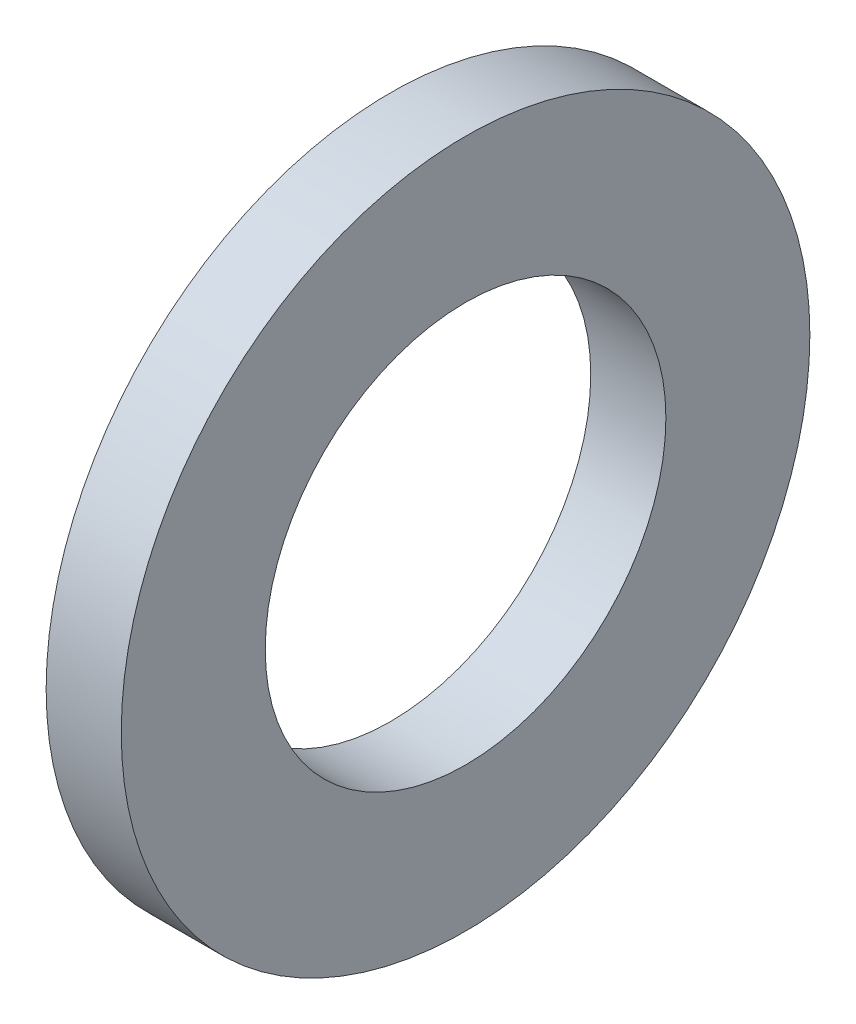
ISO-10303-21;
HEADER;
FILE_DESCRIPTION(('STEP AP214'),'2;1');
FILE_NAME('part.step','',(''),(''),'','','');
FILE_SCHEMA(('AUTOMOTIVE_DESIGN { 1 0 10303 214 1 1 1 1 }'));
ENDSEC;
DATA;
#1=APPLICATION_CONTEXT('core data for automotive mechanical design processes');
#2=APPLICATION_PROTOCOL_DEFINITION('international standard','automotive_design',2000,#1);
#3=PRODUCT_CONTEXT('',#1,'mechanical');
#4=PRODUCT('Part','Part','',(#3));
#5=PRODUCT_RELATED_PRODUCT_CATEGORY('part','',(#4));
#6=PRODUCT_DEFINITION_FORMATION('','',#4);
#7=PRODUCT_DEFINITION_CONTEXT('part definition',#1,'design');
#8=PRODUCT_DEFINITION('design','',#6,#7);
#9=PRODUCT_DEFINITION_SHAPE('','',#8);
#10=(LENGTH_UNIT() NAMED_UNIT(*) SI_UNIT(.MILLI.,.METRE.));
#11=(NAMED_UNIT(*) PLANE_ANGLE_UNIT() SI_UNIT($,.RADIAN.));
#12=(NAMED_UNIT(*) SI_UNIT($,.STERADIAN.) SOLID_ANGLE_UNIT());
#13=UNCERTAINTY_MEASURE_WITH_UNIT(LENGTH_MEASURE(1.E-05),#10,'distance_accuracy_value','');
#14=(GEOMETRIC_REPRESENTATION_CONTEXT(3) GLOBAL_UNCERTAINTY_ASSIGNED_CONTEXT((#13)) GLOBAL_UNIT_ASSIGNED_CONTEXT((#10,
#11,#12)) REPRESENTATION_CONTEXT('',''));
#15=CARTESIAN_POINT('',(0.,0.,0.));
#16=DIRECTION('',(0.,0.,1.));
#17=DIRECTION('',(1.,0.,0.));
#18=AXIS2_PLACEMENT_3D('',#15,#16,#17);
#19=CARTESIAN_POINT('',(0.,0.,-5.5));
#20=DIRECTION('',(1.,0.,0.));
#21=DIRECTION('',(0.,0.,-1.));
#22=AXIS2_PLACEMENT_3D('',#19,#20,#21);
#23=PLANE('',#22);
#24=CARTESIAN_POINT('',(0.,0.,0.));
#25=DIRECTION('',(-1.,0.,0.));
#26=DIRECTION('',(0.,0.,1.));
#27=AXIS2_PLACEMENT_3D('',#24,#25,#26);
#28=CIRCLE('',#27,3.2);
#29=CARTESIAN_POINT('',(0.,0.,3.2));
#30=VERTEX_POINT('',#29);
#31=EDGE_CURVE('E10',#30,#30,#28,.T.);
#32=ORIENTED_EDGE('',*,*,#31,.F.);
#33=EDGE_LOOP('',(#32));
#34=FACE_BOUND('',#33,.T.);
#35=CARTESIAN_POINT('',(0.,0.,0.));
#36=DIRECTION('',(-1.,0.,0.));
#37=DIRECTION('',(0.,0.,1.));
#38=AXIS2_PLACEMENT_3D('',#35,#36,#37);
#39=CIRCLE('',#38,5.5);
#40=CARTESIAN_POINT('',(0.,0.,5.5));
#41=VERTEX_POINT('',#40);
#42=EDGE_CURVE('E41',#41,#41,#39,.T.);
#43=ORIENTED_EDGE('',*,*,#42,.T.);
#44=EDGE_LOOP('',(#43));
#45=FACE_BOUND('',#44,.T.);
#46=ADVANCED_FACE('F27',(#34,#45),#23,.F.);
#47=CARTESIAN_POINT('',(0.,0.,0.));
#48=DIRECTION('',(-1.,0.,0.));
#49=DIRECTION('',(0.,0.,1.));
#50=AXIS2_PLACEMENT_3D('',#47,#48,#49);
#51=CYLINDRICAL_SURFACE('',#50,3.2);
#52=CARTESIAN_POINT('',(1.2,0.,0.));
#53=DIRECTION('',(-1.,0.,0.));
#54=DIRECTION('',(0.,0.,1.));
#55=AXIS2_PLACEMENT_3D('',#52,#53,#54);
#56=CIRCLE('',#55,3.2);
#57=CARTESIAN_POINT('',(1.2,0.,3.2));
#58=VERTEX_POINT('',#57);
#59=EDGE_CURVE('E33',#58,#58,#56,.T.);
#60=ORIENTED_EDGE('',*,*,#59,.F.);
#61=EDGE_LOOP('',(#60));
#62=FACE_BOUND('',#61,.T.);
#63=ORIENTED_EDGE('',*,*,#31,.T.);
#64=EDGE_LOOP('',(#63));
#65=FACE_BOUND('',#64,.T.);
#66=ADVANCED_FACE('F56',(#62,#65),#51,.F.);
#67=CARTESIAN_POINT('',(1.2,0.,-5.5));
#68=DIRECTION('',(-1.,0.,0.));
#69=DIRECTION('',(0.,0.,1.));
#70=AXIS2_PLACEMENT_3D('',#67,#68,#69);
#71=PLANE('',#70);
#72=CARTESIAN_POINT('',(1.2,0.,0.));
#73=DIRECTION('',(-1.,0.,0.));
#74=DIRECTION('',(0.,0.,1.));
#75=AXIS2_PLACEMENT_3D('',#72,#73,#74);
#76=CIRCLE('',#75,5.5);
#77=CARTESIAN_POINT('',(1.2,0.,5.5));
#78=VERTEX_POINT('',#77);
#79=EDGE_CURVE('E37',#78,#78,#76,.T.);
#80=ORIENTED_EDGE('',*,*,#79,.F.);
#81=EDGE_LOOP('',(#80));
#82=FACE_BOUND('',#81,.T.);
#83=ORIENTED_EDGE('',*,*,#59,.T.);
#84=EDGE_LOOP('',(#83));
#85=FACE_BOUND('',#84,.T.);
#86=ADVANCED_FACE('F51',(#82,#85),#71,.F.);
#87=CARTESIAN_POINT('',(0.,0.,0.));
#88=DIRECTION('',(-1.,0.,0.));
#89=DIRECTION('',(0.,0.,1.));
#90=AXIS2_PLACEMENT_3D('',#87,#88,#89);
#91=CYLINDRICAL_SURFACE('',#90,5.5);
#92=ORIENTED_EDGE('',*,*,#42,.F.);
#93=EDGE_LOOP('',(#92));
#94=FACE_BOUND('',#93,.T.);
#95=ORIENTED_EDGE('',*,*,#79,.T.);
#96=EDGE_LOOP('',(#95));
#97=FACE_BOUND('',#96,.T.);
#98=ADVANCED_FACE('F48',(#94,#97),#91,.T.);
#99=CLOSED_SHELL('',(#46,#66,#86,#98));
#100=MANIFOLD_SOLID_BREP('B2',#99);
#101=ADVANCED_BREP_SHAPE_REPRESENTATION('',(#18,#100),#14);
#102=SHAPE_DEFINITION_REPRESENTATION(#9,#101);
ENDSEC;
END-ISO-10303-21;
